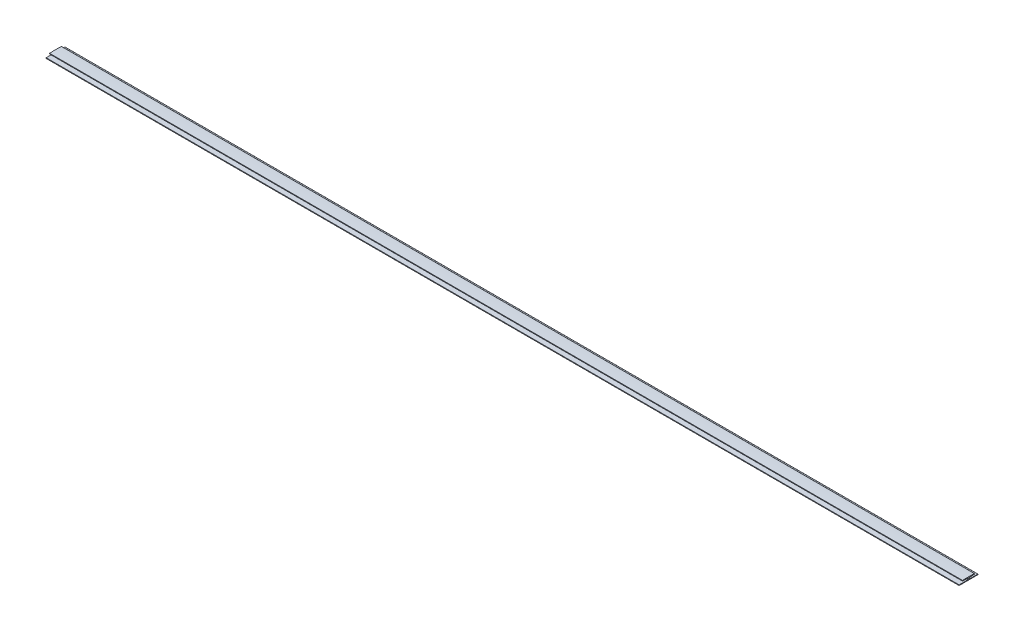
from build123d import *

# Parameters (mm, degrees)
EXTRUDE1_DEPTH      = 609.6
EXTRUDE1_DEPTH_BACK = 609.6


with BuildPart() as part:
    # Sketch1 → Extrude1 (new, two sides: drawn at the far end of the back side and taken through both)
    with BuildSketch(Plane(origin=(0, 0, 0), x_dir=(0, 0, -1), z_dir=(1, 0, 0)).offset(-EXTRUDE1_DEPTH_BACK)):
        with BuildLine():
            Line((-0.396875, 0.023341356), (-12.446, 0.023341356))
            ThreePointArc((-12.446, 0.023341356), (-12.625605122, -0.051053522), (-12.7, -0.230658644))
            Line((-12.7, -0.230658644), (-12.7, -0.53975))
            ThreePointArc((-12.7, -0.53975), (-12.625605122, -0.719355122), (-12.446, -0.79375))
            Line((-12.446, -0.79375), (12.446, -0.79375))
            ThreePointArc((12.446, -0.79375), (12.625605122, -0.719355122), (12.7, -0.53975))
            Line((12.7, -0.53975), (12.7, -0.254))
            ThreePointArc((12.7, -0.254), (12.625605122, -0.074394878), (12.446, 0))
            Line((12.446, 0), (0.396875, 0))
            Line((0.396875, 0), (0.396875, 1.610841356))
            Line((0.396875, 1.610841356), (7.908252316, 2.082150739))
            ThreePointArc((7.908252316, 2.082150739), (8.082846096, 2.167646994), (8.14584756, 2.351558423))
            Line((8.14584756, 2.351558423), (8.127953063, 2.636747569))
            ThreePointArc((8.127953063, 2.636747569), (8.042456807, 2.81134135), (7.858545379, 2.874342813))
            ThreePointArc((7.858545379, 2.874342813), (0, 3.077091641), (-7.858545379, 2.874342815))
            ThreePointArc((-7.858545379, 2.874342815), (-8.042456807, 2.811341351), (-8.127953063, 2.636747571))
            Line((-8.127953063, 2.636747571), (-8.14584756, 2.351558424))
            ThreePointArc((-8.14584756, 2.351558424), (-8.082846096, 2.167646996), (-7.908252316, 2.08215074))
            Line((-7.908252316, 2.08215074), (-0.396875, 1.610841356))
            Line((-0.396875, 1.610841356), (-0.396875, 0.023341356))
        make_face()
    extrude(amount=EXTRUDE1_DEPTH + EXTRUDE1_DEPTH_BACK)


solid = part.part
